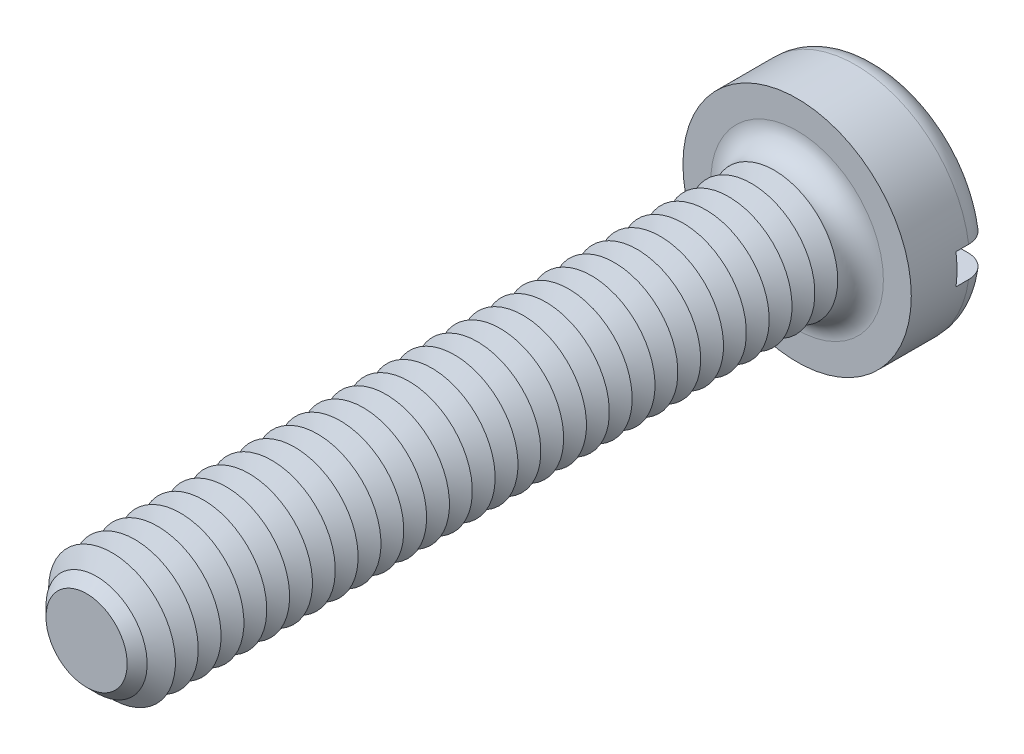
from build123d import *

# Parameters (mm, degrees)
SKETCH3_R           = 2.25
BOSS_EXTRUDE2_DEPTH = 1.6
SKETCH4_R           = 1.25
BOSS_EXTRUDE3_DEPTH = 14
FILLET1_R           = 0.45
CHAMFER1_SIZE       = 0.45
LPATTERN1_COUNT     = 30
LPATTERN1_PITCH     = 0.45
SKETCH8_W           = 4.5
SKETCH8_H           = 0.6
CUT_EXTRUDE1_DEPTH  = 0.7


with BuildPart() as part:
    # Sketch3 → Boss-Extrude2 (new body)
    with BuildSketch(Plane.XY):
        Circle(SKETCH3_R)
    extrude(amount=-BOSS_EXTRUDE2_DEPTH)

    # Sketch4 → Boss-Extrude3 (add)
    with BuildSketch(Plane.XY):
        Circle(SKETCH4_R)
    extrude(amount=BOSS_EXTRUDE3_DEPTH)

    # Fillet1
    fillet1_edges = [part.edges().sort_by_distance(p)[0] for p in [
        (-2.25, 0, -1.6),
        (-1.25, 0, 0),
    ]]
    fillet(fillet1_edges, radius=FILLET1_R)

    # Chamfer1
    chamfer1_edges = [part.edges().sort_by_distance(p)[0] for p in [
        (-1.25, 0, 14),
    ]]
    chamfer(chamfer1_edges, length=CHAMFER1_SIZE)

    # Sketch6 → Cut-Revolve1 (revolve, cut)
    with BuildSketch(Plane(origin=(0, 0, 0), x_dir=(0, 0, -1), z_dir=(1, 0, 0)), mode=Mode.PRIVATE) as cut_revolve1_sk:
        Polygon((-0.45, 1.25), (-0.675, 0.860288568), (-0.9, 1.25), align=None)
    cut_revolve1 = revolve(cut_revolve1_sk.sketch.rotate(Axis((0, 0, -1.694361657), (0, 0, 1)), 90), axis=Axis((0, 0, -1.694361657), (0, 0, 1)), mode=Mode.SUBTRACT)

    # LPattern1: Cut-Revolve1 ×30
    with Locations(*[(0, 0, i * LPATTERN1_PITCH) for i in range(1, LPATTERN1_COUNT)]):
        add(cut_revolve1, mode=Mode.SUBTRACT)

    # Sketch8 → Cut-Extrude1 (cut)
    with BuildSketch(Plane(origin=(0, 0, -1.6), x_dir=(-1, 0, 0), z_dir=(0, 0, -1))):
        Rectangle(SKETCH8_W, SKETCH8_H)
    extrude(amount=-CUT_EXTRUDE1_DEPTH, mode=Mode.SUBTRACT)


solid = part.part
